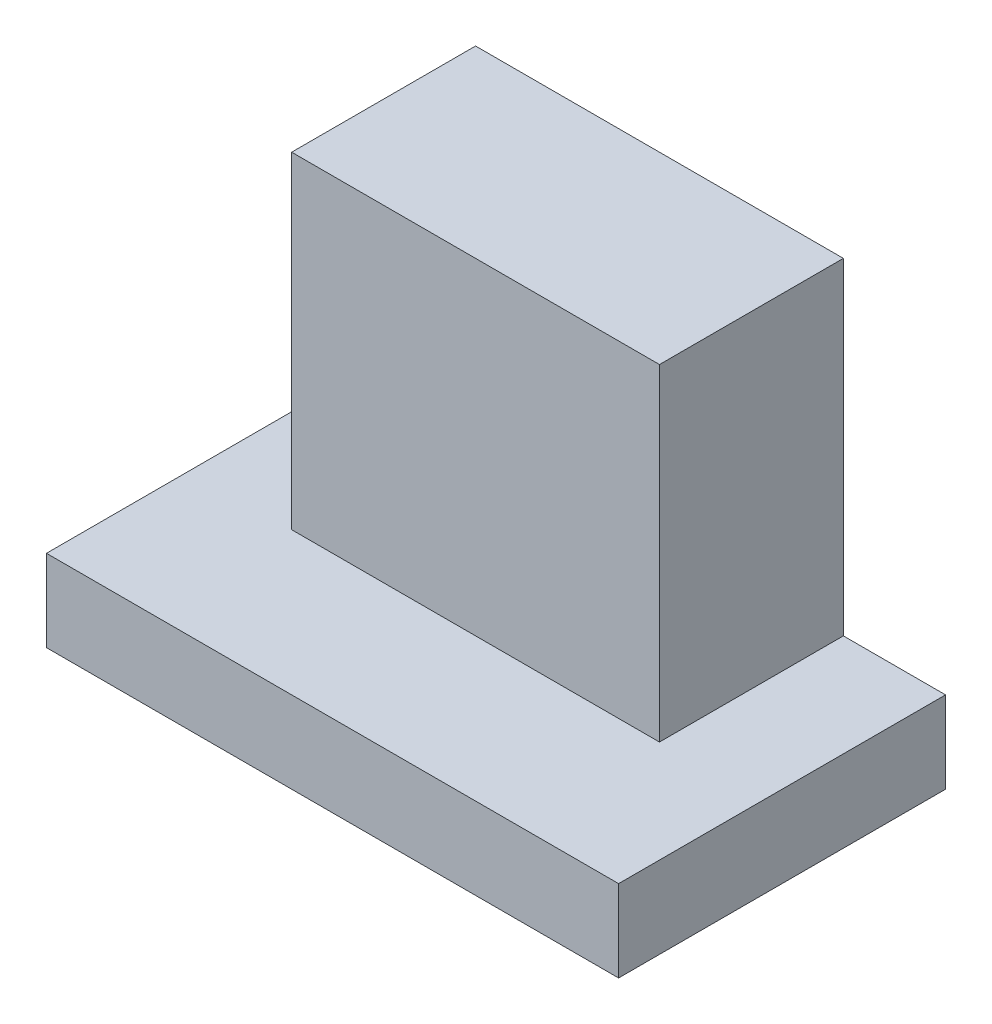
from build123d import *

# Parameters (mm, degrees)
SKETCH_1_W      = 140
SKETCH_1_H      = 80
EXTRUDE_1_DEPTH = 20
SKETCH_2_W      = 90
SKETCH_2_H      = 45
EXTRUDE_2_DEPTH = 80


with BuildPart() as part:
    # Sketch 1 → Extrude 1 (new body)
    with BuildSketch(Plane(origin=(0, 0, 0), x_dir=(1, 0, 0), z_dir=(0, 1, 0))):
        with Locations((0, -40)):
            Rectangle(SKETCH_1_W, SKETCH_1_H)
    extrude(amount=EXTRUDE_1_DEPTH)

    # Sketch 2 → Extrude 2 (add)
    with BuildSketch(Plane(origin=(0, 20, 0), x_dir=(1, 0, 0), z_dir=(0, 1, 0))):
        with Locations((0, -22.5)):
            Rectangle(SKETCH_2_W, SKETCH_2_H)
    extrude(amount=EXTRUDE_2_DEPTH)


solid = part.part
